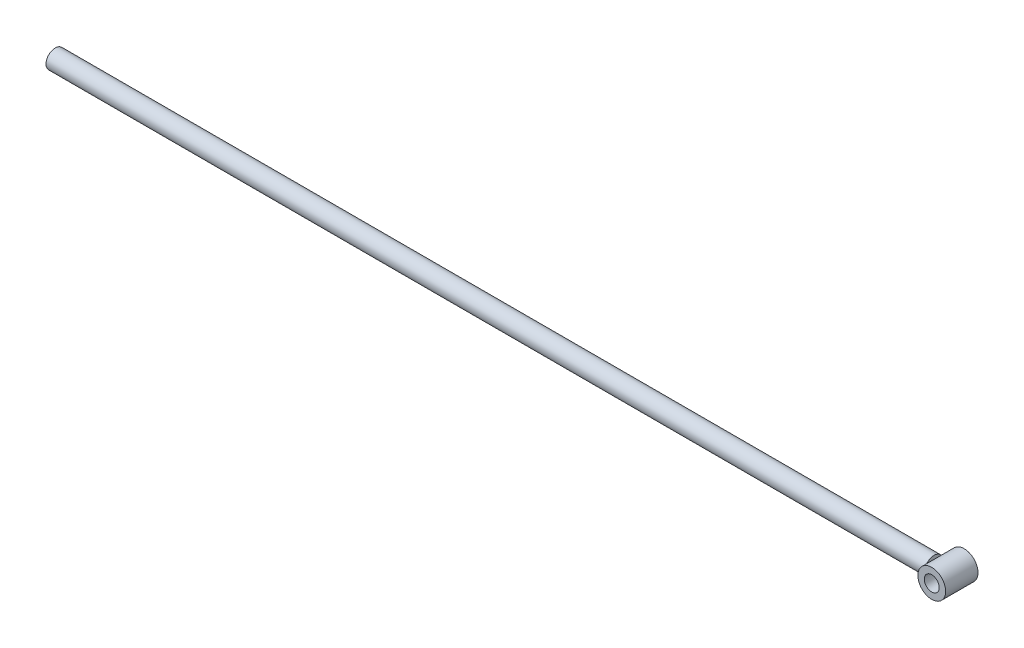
ISO-10303-21;
HEADER;
FILE_DESCRIPTION(('STEP AP214'),'2;1');
FILE_NAME('part.step','',(''),(''),'','','');
FILE_SCHEMA(('AUTOMOTIVE_DESIGN { 1 0 10303 214 1 1 1 1 }'));
ENDSEC;
DATA;
#1=APPLICATION_CONTEXT('core data for automotive mechanical design processes');
#2=APPLICATION_PROTOCOL_DEFINITION('international standard','automotive_design',2000,#1);
#3=PRODUCT_CONTEXT('',#1,'mechanical');
#4=PRODUCT('Part','Part','',(#3));
#5=PRODUCT_RELATED_PRODUCT_CATEGORY('part','',(#4));
#6=PRODUCT_DEFINITION_FORMATION('','',#4);
#7=PRODUCT_DEFINITION_CONTEXT('part definition',#1,'design');
#8=PRODUCT_DEFINITION('design','',#6,#7);
#9=PRODUCT_DEFINITION_SHAPE('','',#8);
#10=(LENGTH_UNIT() NAMED_UNIT(*) SI_UNIT(.MILLI.,.METRE.));
#11=(NAMED_UNIT(*) PLANE_ANGLE_UNIT() SI_UNIT($,.RADIAN.));
#12=(NAMED_UNIT(*) SI_UNIT($,.STERADIAN.) SOLID_ANGLE_UNIT());
#13=UNCERTAINTY_MEASURE_WITH_UNIT(LENGTH_MEASURE(1.E-05),#10,'distance_accuracy_value','');
#14=(GEOMETRIC_REPRESENTATION_CONTEXT(3) GLOBAL_UNCERTAINTY_ASSIGNED_CONTEXT((#13)) GLOBAL_UNIT_ASSIGNED_CONTEXT((#10,
#11,#12)) REPRESENTATION_CONTEXT('',''));
#15=CARTESIAN_POINT('',(0.,0.,0.));
#16=DIRECTION('',(0.,0.,1.));
#17=DIRECTION('',(1.,0.,0.));
#18=AXIS2_PLACEMENT_3D('',#15,#16,#17);
#19=CARTESIAN_POINT('',(965.,0.,17.5));
#20=DIRECTION('',(0.,0.,1.));
#21=DIRECTION('',(1.,0.,0.));
#22=AXIS2_PLACEMENT_3D('',#19,#20,#21);
#23=PLANE('',#22);
#24=CARTESIAN_POINT('',(965.,0.,17.5));
#25=DIRECTION('',(0.,0.,1.));
#26=DIRECTION('',(1.,0.,0.));
#27=AXIS2_PLACEMENT_3D('',#24,#25,#26);
#28=CIRCLE('',#27,15.);
#29=CARTESIAN_POINT('',(980.,0.,17.5));
#30=VERTEX_POINT('',#29);
#31=EDGE_CURVE('E11',#30,#30,#28,.T.);
#32=ORIENTED_EDGE('',*,*,#31,.T.);
#33=EDGE_LOOP('',(#32));
#34=FACE_BOUND('',#33,.T.);
#35=CARTESIAN_POINT('',(965.,0.,17.5));
#36=DIRECTION('',(0.,0.,1.));
#37=DIRECTION('',(1.,0.,0.));
#38=AXIS2_PLACEMENT_3D('',#35,#36,#37);
#39=CIRCLE('',#38,8.10000000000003);
#40=CARTESIAN_POINT('',(973.1,0.,17.5));
#41=VERTEX_POINT('',#40);
#42=EDGE_CURVE('E49',#41,#41,#39,.T.);
#43=ORIENTED_EDGE('',*,*,#42,.F.);
#44=EDGE_LOOP('',(#43));
#45=FACE_BOUND('',#44,.T.);
#46=ADVANCED_FACE('F38',(#34,#45),#23,.T.);
#47=CARTESIAN_POINT('',(965.,0.,-17.5));
#48=DIRECTION('',(0.,0.,1.));
#49=DIRECTION('',(1.,0.,0.));
#50=AXIS2_PLACEMENT_3D('',#47,#48,#49);
#51=PLANE('',#50);
#52=CARTESIAN_POINT('',(965.,0.,-17.5));
#53=DIRECTION('',(0.,0.,1.));
#54=DIRECTION('',(1.,0.,0.));
#55=AXIS2_PLACEMENT_3D('',#52,#53,#54);
#56=CIRCLE('',#55,15.);
#57=CARTESIAN_POINT('',(980.,0.,-17.5));
#58=VERTEX_POINT('',#57);
#59=EDGE_CURVE('E42',#58,#58,#56,.T.);
#60=ORIENTED_EDGE('',*,*,#59,.F.);
#61=EDGE_LOOP('',(#60));
#62=FACE_BOUND('',#61,.T.);
#63=CARTESIAN_POINT('',(965.,0.,-17.5));
#64=DIRECTION('',(0.,0.,1.));
#65=DIRECTION('',(1.,0.,0.));
#66=AXIS2_PLACEMENT_3D('',#63,#64,#65);
#67=CIRCLE('',#66,8.10000000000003);
#68=CARTESIAN_POINT('',(973.1,0.,-17.5));
#69=VERTEX_POINT('',#68);
#70=EDGE_CURVE('E51',#69,#69,#67,.T.);
#71=ORIENTED_EDGE('',*,*,#70,.T.);
#72=EDGE_LOOP('',(#71));
#73=FACE_BOUND('',#72,.T.);
#74=ADVANCED_FACE('F61',(#62,#73),#51,.F.);
#75=CARTESIAN_POINT('',(965.,0.,17.5));
#76=DIRECTION('',(0.,0.,-1.));
#77=DIRECTION('',(-1.,0.,0.));
#78=AXIS2_PLACEMENT_3D('',#75,#76,#77);
#79=CYLINDRICAL_SURFACE('',#78,15.);
#80=ORIENTED_EDGE('',*,*,#31,.F.);
#81=EDGE_LOOP('',(#80));
#82=FACE_BOUND('',#81,.T.);
#83=ORIENTED_EDGE('',*,*,#59,.T.);
#84=EDGE_LOOP('',(#83));
#85=FACE_BOUND('',#84,.T.);
#86=ADVANCED_FACE('F40',(#82,#85),#79,.T.);
#87=CARTESIAN_POINT('',(965.,0.,17.5));
#88=DIRECTION('',(0.,0.,-1.));
#89=DIRECTION('',(-1.,0.,0.));
#90=AXIS2_PLACEMENT_3D('',#87,#88,#89);
#91=CYLINDRICAL_SURFACE('',#90,8.10000000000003);
#92=ORIENTED_EDGE('',*,*,#42,.T.);
#93=EDGE_LOOP('',(#92));
#94=FACE_BOUND('',#93,.T.);
#95=ORIENTED_EDGE('',*,*,#70,.F.);
#96=EDGE_LOOP('',(#95));
#97=FACE_BOUND('',#96,.T.);
#98=ADVANCED_FACE('F57',(#94,#97),#91,.F.);
#99=CLOSED_SHELL('',(#46,#74,#86,#98));
#100=MANIFOLD_SOLID_BREP('B2',#99);
#101=CARTESIAN_POINT('',(950.,0.,0.));
#102=DIRECTION('',(-1.,0.,0.));
#103=DIRECTION('',(0.,0.,1.));
#104=AXIS2_PLACEMENT_3D('',#101,#102,#103);
#105=CYLINDRICAL_SURFACE('',#104,10.);
#106=CARTESIAN_POINT('',(950.,0.,0.));
#107=DIRECTION('',(1.,0.,0.));
#108=DIRECTION('',(0.,0.,-1.));
#109=AXIS2_PLACEMENT_3D('',#106,#107,#108);
#110=CIRCLE('',#109,10.);
#111=CARTESIAN_POINT('',(950.,0.,10.));
#112=VERTEX_POINT('',#111);
#113=EDGE_CURVE('E37',#112,#112,#110,.T.);
#114=CARTESIAN_POINT('',(0.,0.,0.));
#115=DIRECTION('',(1.,0.,0.));
#116=DIRECTION('',(0.,0.,-1.));
#117=AXIS2_PLACEMENT_3D('',#114,#115,#116);
#118=CIRCLE('',#117,10.);
#119=CARTESIAN_POINT('',(-1.11022302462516E-13,0.,10.));
#120=VERTEX_POINT('',#119);
#121=EDGE_CURVE('E102',#120,#120,#118,.T.);
#122=CARTESIAN_POINT('',(950.,0.,10.));
#123=CARTESIAN_POINT('',(940.104166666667,0.,10.));
#124=CARTESIAN_POINT('',(930.208333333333,0.,10.));
#125=CARTESIAN_POINT('',(910.416666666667,0.,10.));
#126=CARTESIAN_POINT('',(900.520833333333,0.,10.));
#127=CARTESIAN_POINT('',(880.729166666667,0.,10.));
#128=CARTESIAN_POINT('',(870.833333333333,0.,10.));
#129=CARTESIAN_POINT('',(851.041666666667,0.,10.));
#130=CARTESIAN_POINT('',(841.145833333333,0.,10.));
#131=CARTESIAN_POINT('',(821.354166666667,0.,10.));
#132=CARTESIAN_POINT('',(811.458333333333,0.,10.));
#133=CARTESIAN_POINT('',(791.666666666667,0.,10.));
#134=CARTESIAN_POINT('',(781.770833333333,0.,10.));
#135=CARTESIAN_POINT('',(761.979166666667,0.,10.));
#136=CARTESIAN_POINT('',(752.083333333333,0.,10.));
#137=CARTESIAN_POINT('',(732.291666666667,0.,10.));
#138=CARTESIAN_POINT('',(722.395833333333,0.,10.));
#139=CARTESIAN_POINT('',(702.604166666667,0.,10.));
#140=CARTESIAN_POINT('',(692.708333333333,0.,10.));
#141=CARTESIAN_POINT('',(672.916666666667,0.,10.));
#142=CARTESIAN_POINT('',(663.020833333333,0.,10.));
#143=CARTESIAN_POINT('',(643.229166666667,0.,10.));
#144=CARTESIAN_POINT('',(633.333333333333,0.,10.));
#145=CARTESIAN_POINT('',(613.541666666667,0.,10.));
#146=CARTESIAN_POINT('',(603.645833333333,0.,10.));
#147=CARTESIAN_POINT('',(583.854166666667,0.,10.));
#148=CARTESIAN_POINT('',(573.958333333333,0.,10.));
#149=CARTESIAN_POINT('',(554.166666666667,0.,10.));
#150=CARTESIAN_POINT('',(544.270833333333,0.,10.));
#151=CARTESIAN_POINT('',(524.479166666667,0.,10.));
#152=CARTESIAN_POINT('',(514.583333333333,0.,10.));
#153=CARTESIAN_POINT('',(494.791666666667,0.,10.));
#154=CARTESIAN_POINT('',(484.895833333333,0.,10.));
#155=CARTESIAN_POINT('',(465.104166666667,0.,10.));
#156=CARTESIAN_POINT('',(455.208333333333,0.,10.));
#157=CARTESIAN_POINT('',(435.416666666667,0.,10.));
#158=CARTESIAN_POINT('',(425.520833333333,0.,10.));
#159=CARTESIAN_POINT('',(405.729166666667,0.,10.));
#160=CARTESIAN_POINT('',(395.833333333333,0.,10.));
#161=CARTESIAN_POINT('',(376.041666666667,0.,10.));
#162=CARTESIAN_POINT('',(366.145833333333,0.,10.));
#163=CARTESIAN_POINT('',(346.354166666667,0.,10.));
#164=CARTESIAN_POINT('',(336.458333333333,0.,10.));
#165=CARTESIAN_POINT('',(316.666666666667,0.,10.));
#166=CARTESIAN_POINT('',(306.770833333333,0.,10.));
#167=CARTESIAN_POINT('',(286.979166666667,0.,10.));
#168=CARTESIAN_POINT('',(277.083333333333,0.,10.));
#169=CARTESIAN_POINT('',(257.291666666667,0.,10.));
#170=CARTESIAN_POINT('',(247.395833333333,0.,10.));
#171=CARTESIAN_POINT('',(227.604166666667,0.,10.));
#172=CARTESIAN_POINT('',(217.708333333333,0.,10.));
#173=CARTESIAN_POINT('',(197.916666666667,0.,10.));
#174=CARTESIAN_POINT('',(188.020833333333,0.,10.));
#175=CARTESIAN_POINT('',(168.229166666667,0.,10.));
#176=CARTESIAN_POINT('',(158.333333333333,0.,10.));
#177=CARTESIAN_POINT('',(138.541666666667,0.,10.));
#178=CARTESIAN_POINT('',(128.645833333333,0.,10.));
#179=CARTESIAN_POINT('',(108.854166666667,0.,10.));
#180=CARTESIAN_POINT('',(98.9583333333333,0.,10.));
#181=CARTESIAN_POINT('',(79.1666666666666,0.,10.));
#182=CARTESIAN_POINT('',(69.2708333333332,0.,10.));
#183=CARTESIAN_POINT('',(49.4791666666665,0.,10.));
#184=CARTESIAN_POINT('',(39.5833333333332,0.,10.));
#185=CARTESIAN_POINT('',(19.7916666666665,0.,10.));
#186=CARTESIAN_POINT('',(9.89583333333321,0.,10.));
#187=CARTESIAN_POINT('',(-1.11022302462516E-13,0.,10.));
#188=B_SPLINE_CURVE_WITH_KNOTS('',3,(#122,#123,#124,#125,#126,#127,#128,#129,#130,#131,#132,
#133,#134,#135,#136,#137,#138,#139,#140,#141,#142,#143,#144,#145,#146,#147,#148,#149,#150,#151,
#152,#153,#154,#155,#156,#157,#158,#159,#160,#161,#162,#163,#164,#165,#166,#167,#168,#169,#170,
#171,#172,#173,#174,#175,#176,#177,#178,#179,#180,#181,#182,#183,#184,#185,#186,#187),
.UNSPECIFIED.,.F.,.F.,(4,2,2,2,2,2,2,2,2,2,2,2,2,2,2,2,2,2,2,2,2,2,2,2,2,2,2,2,2,2,2,2,4),(0.,
29.6875000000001,59.3750000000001,89.0625,118.75,148.4375,178.125,207.8125,237.5,267.1875,
296.875,326.5625,356.25,385.9375,415.625,445.3125,475.,504.6875,534.375,564.0625,593.75,
623.4375,653.125,682.8125,712.5,742.1875,771.875,801.5625,831.25,860.9375,890.625,920.3125,
950.),.UNSPECIFIED.);
#189=EDGE_CURVE('BSEAM99',#112,#120,#188,.T.);
#190=ORIENTED_EDGE('',*,*,#113,.F.);
#191=ORIENTED_EDGE('',*,*,#121,.T.);
#192=ORIENTED_EDGE('',*,*,#189,.T.);
#193=ORIENTED_EDGE('',*,*,#189,.F.);
#194=EDGE_LOOP('',(#190,#192,#191,#193));
#195=FACE_BOUND('',#194,.T.);
#196=ADVANCED_FACE('F99',(#195),#105,.T.);
#197=CARTESIAN_POINT('',(950.,0.,0.));
#198=DIRECTION('',(1.,0.,0.));
#199=DIRECTION('',(0.,0.,-1.));
#200=AXIS2_PLACEMENT_3D('',#197,#198,#199);
#201=PLANE('',#200);
#202=ORIENTED_EDGE('',*,*,#113,.T.);
#203=EDGE_LOOP('',(#202));
#204=FACE_BOUND('',#203,.T.);
#205=ADVANCED_FACE('F114',(#204),#201,.T.);
#206=CARTESIAN_POINT('',(0.,0.,0.));
#207=DIRECTION('',(1.,0.,0.));
#208=DIRECTION('',(0.,0.,-1.));
#209=AXIS2_PLACEMENT_3D('',#206,#207,#208);
#210=PLANE('',#209);
#211=ORIENTED_EDGE('',*,*,#121,.F.);
#212=EDGE_LOOP('',(#211));
#213=FACE_BOUND('',#212,.T.);
#214=ADVANCED_FACE('F112',(#213),#210,.F.);
#215=CLOSED_SHELL('',(#196,#205,#214));
#216=MANIFOLD_SOLID_BREP('B6',#215);
#217=ADVANCED_BREP_SHAPE_REPRESENTATION('',(#18,#100,#216),#14);
#218=SHAPE_DEFINITION_REPRESENTATION(#9,#217);
ENDSEC;
END-ISO-10303-21;
